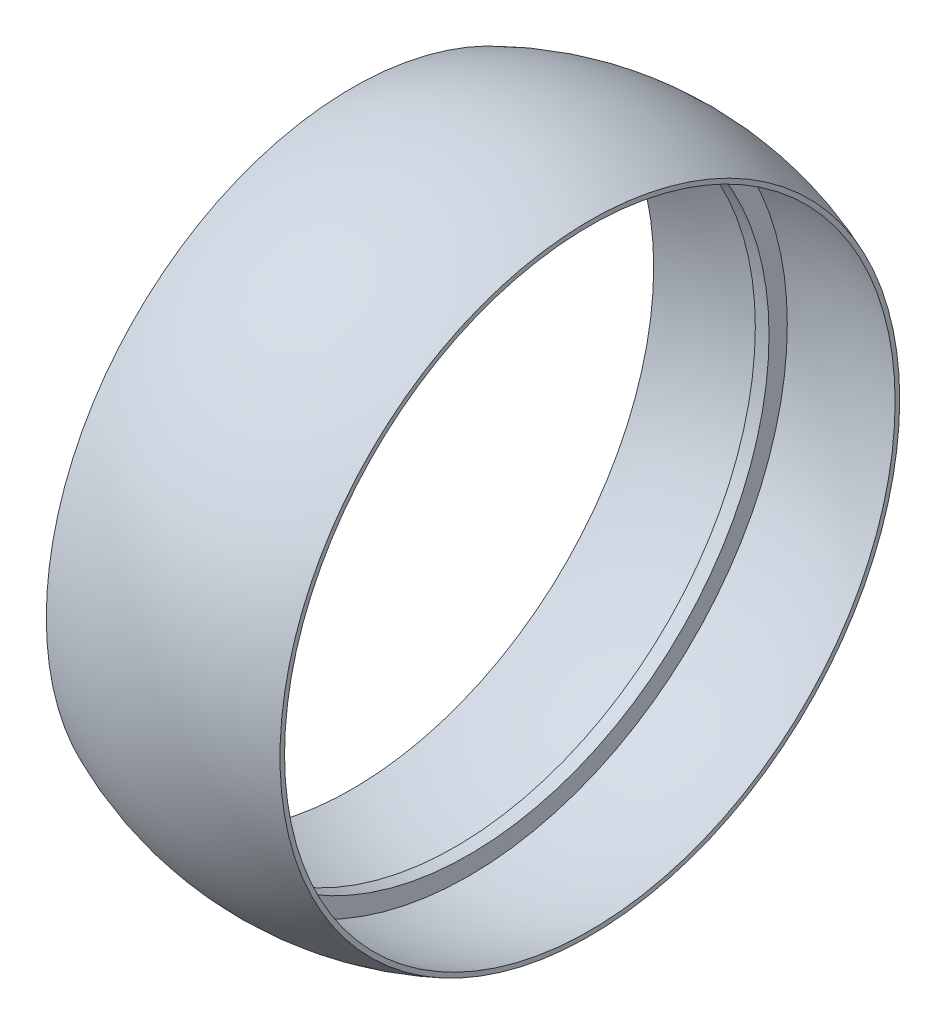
ISO-10303-21;
HEADER;
FILE_DESCRIPTION(('STEP AP214'),'2;1');
FILE_NAME('part.step','',(''),(''),'','','');
FILE_SCHEMA(('AUTOMOTIVE_DESIGN { 1 0 10303 214 1 1 1 1 }'));
ENDSEC;
DATA;
#1=APPLICATION_CONTEXT('core data for automotive mechanical design processes');
#2=APPLICATION_PROTOCOL_DEFINITION('international standard','automotive_design',2000,#1);
#3=PRODUCT_CONTEXT('',#1,'mechanical');
#4=PRODUCT('Part','Part','',(#3));
#5=PRODUCT_RELATED_PRODUCT_CATEGORY('part','',(#4));
#6=PRODUCT_DEFINITION_FORMATION('','',#4);
#7=PRODUCT_DEFINITION_CONTEXT('part definition',#1,'design');
#8=PRODUCT_DEFINITION('design','',#6,#7);
#9=PRODUCT_DEFINITION_SHAPE('','',#8);
#10=(LENGTH_UNIT() NAMED_UNIT(*) SI_UNIT(.MILLI.,.METRE.));
#11=(NAMED_UNIT(*) PLANE_ANGLE_UNIT() SI_UNIT($,.RADIAN.));
#12=(NAMED_UNIT(*) SI_UNIT($,.STERADIAN.) SOLID_ANGLE_UNIT());
#13=UNCERTAINTY_MEASURE_WITH_UNIT(LENGTH_MEASURE(1.E-05),#10,'distance_accuracy_value','');
#14=(GEOMETRIC_REPRESENTATION_CONTEXT(3) GLOBAL_UNCERTAINTY_ASSIGNED_CONTEXT((#13)) GLOBAL_UNIT_ASSIGNED_CONTEXT((#10,
#11,#12)) REPRESENTATION_CONTEXT('',''));
#15=CARTESIAN_POINT('',(0.,0.,0.));
#16=DIRECTION('',(0.,0.,1.));
#17=DIRECTION('',(1.,0.,0.));
#18=AXIS2_PLACEMENT_3D('',#15,#16,#17);
#19=CARTESIAN_POINT('',(-14.76270675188,0.,0.));
#20=DIRECTION('',(1.,0.,0.));
#21=DIRECTION('',(0.,0.,-1.));
#22=AXIS2_PLACEMENT_3D('',#19,#20,#21);
#23=CYLINDRICAL_SURFACE('',#22,32.84864505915);
#24=CARTESIAN_POINT('',(-0.699999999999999,0.,0.));
#25=DIRECTION('',(1.,0.,0.));
#26=DIRECTION('',(0.,0.,-1.));
#27=AXIS2_PLACEMENT_3D('',#24,#25,#26);
#28=CIRCLE('',#27,32.84864505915);
#29=CARTESIAN_POINT('',(-0.699999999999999,0.,-32.84864505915));
#30=VERTEX_POINT('',#29);
#31=EDGE_CURVE('E19',#30,#30,#28,.F.);
#32=ORIENTED_EDGE('',*,*,#31,.F.);
#33=EDGE_LOOP('',(#32));
#34=FACE_BOUND('',#33,.T.);
#35=CARTESIAN_POINT('',(-2.2,0.,0.));
#36=DIRECTION('',(1.,0.,0.));
#37=DIRECTION('',(0.,0.,-1.));
#38=AXIS2_PLACEMENT_3D('',#35,#36,#37);
#39=CIRCLE('',#38,32.84864505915);
#40=CARTESIAN_POINT('',(-2.2,0.,-32.84864505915));
#41=VERTEX_POINT('',#40);
#42=EDGE_CURVE('E41',#41,#41,#39,.F.);
#43=ORIENTED_EDGE('',*,*,#42,.T.);
#44=EDGE_LOOP('',(#43));
#45=FACE_BOUND('',#44,.T.);
#46=ADVANCED_FACE('F15',(#34,#45),#23,.F.);
#47=CARTESIAN_POINT('',(-0.7,0.,0.));
#48=DIRECTION('',(1.,0.,0.));
#49=DIRECTION('',(0.,0.,-1.));
#50=AXIS2_PLACEMENT_3D('',#47,#48,#49);
#51=PLANE('',#50);
#52=ORIENTED_EDGE('',*,*,#31,.T.);
#53=EDGE_LOOP('',(#52));
#54=FACE_BOUND('',#53,.T.);
#55=CARTESIAN_POINT('',(-0.699999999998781,1.99753408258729E-12,0.));
#56=DIRECTION('',(1.,0.,0.));
#57=DIRECTION('',(0.,0.,-1.));
#58=AXIS2_PLACEMENT_3D('',#55,#56,#57);
#59=CIRCLE('',#58,34.8486450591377);
#60=CARTESIAN_POINT('',(-0.699999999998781,1.99753408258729E-12,-34.8486450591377));
#61=VERTEX_POINT('',#60);
#62=EDGE_CURVE('E39',#61,#61,#59,.T.);
#63=ORIENTED_EDGE('',*,*,#62,.T.);
#64=EDGE_LOOP('',(#63));
#65=FACE_BOUND('',#64,.T.);
#66=ADVANCED_FACE('F48',(#54,#65),#51,.T.);
#67=CARTESIAN_POINT('',(-2.2,0.,0.));
#68=DIRECTION('',(1.,0.,0.));
#69=DIRECTION('',(0.,0.,-1.));
#70=AXIS2_PLACEMENT_3D('',#67,#68,#69);
#71=PLANE('',#70);
#72=ORIENTED_EDGE('',*,*,#42,.F.);
#73=EDGE_LOOP('',(#72));
#74=FACE_BOUND('',#73,.T.);
#75=CARTESIAN_POINT('',(-2.20000000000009,-2.19126422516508E-12,0.));
#76=DIRECTION('',(1.,0.,0.));
#77=DIRECTION('',(0.,0.,-1.));
#78=AXIS2_PLACEMENT_3D('',#75,#76,#77);
#79=CIRCLE('',#78,34.848645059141);
#80=CARTESIAN_POINT('',(-2.20000000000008,-2.19126422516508E-12,-34.8486450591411));
#81=VERTEX_POINT('',#80);
#82=EDGE_CURVE('E36',#81,#81,#79,.F.);
#83=ORIENTED_EDGE('',*,*,#82,.T.);
#84=EDGE_LOOP('',(#83));
#85=FACE_BOUND('',#84,.T.);
#86=ADVANCED_FACE('F57',(#74,#85),#71,.F.);
#87=CARTESIAN_POINT('',(2.49821472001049,1.99753408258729E-12,0.));
#88=DIRECTION('',(1.,0.,0.));
#89=DIRECTION('',(0.,0.,-1.));
#90=AXIS2_PLACEMENT_3D('',#87,#88,#89);
#91=DEGENERATE_TOROIDAL_SURFACE('',#90,2.60126234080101,32.4055900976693,.T.);
#92=CARTESIAN_POINT('',(12.5372932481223,1.99753408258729E-12,0.));
#93=DIRECTION('',(1.,0.,0.));
#94=DIRECTION('',(0.,0.,-1.));
#95=AXIS2_PLACEMENT_3D('',#92,#93,#94);
#96=CIRCLE('',#95,33.4126104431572);
#97=CARTESIAN_POINT('',(12.5372932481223,1.99753408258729E-12,-33.4126104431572));
#98=VERTEX_POINT('',#97);
#99=EDGE_CURVE('E33',#98,#98,#96,.F.);
#100=ORIENTED_EDGE('',*,*,#99,.F.);
#101=EDGE_LOOP('',(#100));
#102=FACE_BOUND('',#101,.T.);
#103=ORIENTED_EDGE('',*,*,#62,.F.);
#104=EDGE_LOOP('',(#103));
#105=FACE_BOUND('',#104,.T.);
#106=ADVANCED_FACE('F78',(#102,#105),#91,.F.);
#107=CARTESIAN_POINT('',(-2.50000000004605,-2.1912674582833E-12,0.));
#108=DIRECTION('',(1.,0.,0.));
#109=DIRECTION('',(0.,0.,-1.));
#110=AXIS2_PLACEMENT_3D('',#107,#108,#109);
#111=DEGENERATE_TOROIDAL_SURFACE('',#110,1.63754071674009,33.212459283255,.T.);
#112=ORIENTED_EDGE('',*,*,#82,.F.);
#113=EDGE_LOOP('',(#112));
#114=FACE_BOUND('',#113,.T.);
#115=CARTESIAN_POINT('',(-13.4627067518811,-2.19138560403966E-12,0.));
#116=DIRECTION('',(1.,0.,0.));
#117=DIRECTION('',(0.,0.,-1.));
#118=AXIS2_PLACEMENT_3D('',#115,#116,#117);
#119=CIRCLE('',#118,32.9885616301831);
#120=CARTESIAN_POINT('',(-13.4627067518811,-2.19138560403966E-12,-32.9885616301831));
#121=VERTEX_POINT('',#120);
#122=EDGE_CURVE('E28',#121,#121,#119,.F.);
#123=ORIENTED_EDGE('',*,*,#122,.T.);
#124=EDGE_LOOP('',(#123));
#125=FACE_BOUND('',#124,.T.);
#126=ADVANCED_FACE('F72',(#114,#125),#111,.F.);
#127=CARTESIAN_POINT('',(12.53729324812,0.,0.));
#128=DIRECTION('',(1.,0.,0.));
#129=DIRECTION('',(0.,0.,-1.));
#130=AXIS2_PLACEMENT_3D('',#127,#128,#129);
#131=PLANE('',#130);
#132=ORIENTED_EDGE('',*,*,#99,.T.);
#133=EDGE_LOOP('',(#132));
#134=FACE_BOUND('',#133,.T.);
#135=CARTESIAN_POINT('',(12.5372932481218,-9.67604831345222E-13,0.));
#136=DIRECTION('',(1.,0.,0.));
#137=DIRECTION('',(0.,0.,-1.));
#138=AXIS2_PLACEMENT_3D('',#135,#136,#137);
#139=CIRCLE('',#138,33.9126104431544);
#140=CARTESIAN_POINT('',(12.5372932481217,-9.67604831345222E-13,-33.9126104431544));
#141=VERTEX_POINT('',#140);
#142=EDGE_CURVE('E23',#141,#141,#139,.F.);
#143=ORIENTED_EDGE('',*,*,#142,.F.);
#144=EDGE_LOOP('',(#143));
#145=FACE_BOUND('',#144,.T.);
#146=ADVANCED_FACE('F65',(#134,#145),#131,.T.);
#147=CARTESIAN_POINT('',(-13.46270675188,0.,0.));
#148=DIRECTION('',(1.,0.,0.));
#149=DIRECTION('',(0.,0.,-1.));
#150=AXIS2_PLACEMENT_3D('',#147,#148,#149);
#151=PLANE('',#150);
#152=ORIENTED_EDGE('',*,*,#122,.F.);
#153=EDGE_LOOP('',(#152));
#154=FACE_BOUND('',#153,.T.);
#155=CARTESIAN_POINT('',(-13.4627067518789,-9.69673526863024E-13,0.));
#156=DIRECTION('',(1.,0.,0.));
#157=DIRECTION('',(0.,0.,-1.));
#158=AXIS2_PLACEMENT_3D('',#155,#156,#157);
#159=CIRCLE('',#158,33.4885616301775);
#160=CARTESIAN_POINT('',(-13.4627067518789,-9.69673526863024E-13,-33.4885616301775));
#161=VERTEX_POINT('',#160);
#162=EDGE_CURVE('E10',#161,#161,#159,.T.);
#163=ORIENTED_EDGE('',*,*,#162,.F.);
#164=EDGE_LOOP('',(#163));
#165=FACE_BOUND('',#164,.T.);
#166=ADVANCED_FACE('F61',(#154,#165),#151,.F.);
#167=CARTESIAN_POINT('',(0.040820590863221,-9.68599115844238E-13,0.));
#168=DIRECTION('',(1.,0.,0.));
#169=DIRECTION('',(0.,0.,-1.));
#170=AXIS2_PLACEMENT_3D('',#167,#168,#169);
#171=DEGENERATE_TOROIDAL_SURFACE('',#170,2.82746362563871,33.5029578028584,.T.);
#172=ORIENTED_EDGE('',*,*,#162,.T.);
#173=EDGE_LOOP('',(#172));
#174=FACE_BOUND('',#173,.T.);
#175=ORIENTED_EDGE('',*,*,#142,.T.);
#176=EDGE_LOOP('',(#175));
#177=FACE_BOUND('',#176,.T.);
#178=ADVANCED_FACE('F17',(#174,#177),#171,.T.);
#179=CLOSED_SHELL('',(#46,#66,#86,#106,#126,#146,#166,#178));
#180=MANIFOLD_SOLID_BREP('B1',#179);
#181=ADVANCED_BREP_SHAPE_REPRESENTATION('',(#18,#180),#14);
#182=SHAPE_DEFINITION_REPRESENTATION(#9,#181);
ENDSEC;
END-ISO-10303-21;
